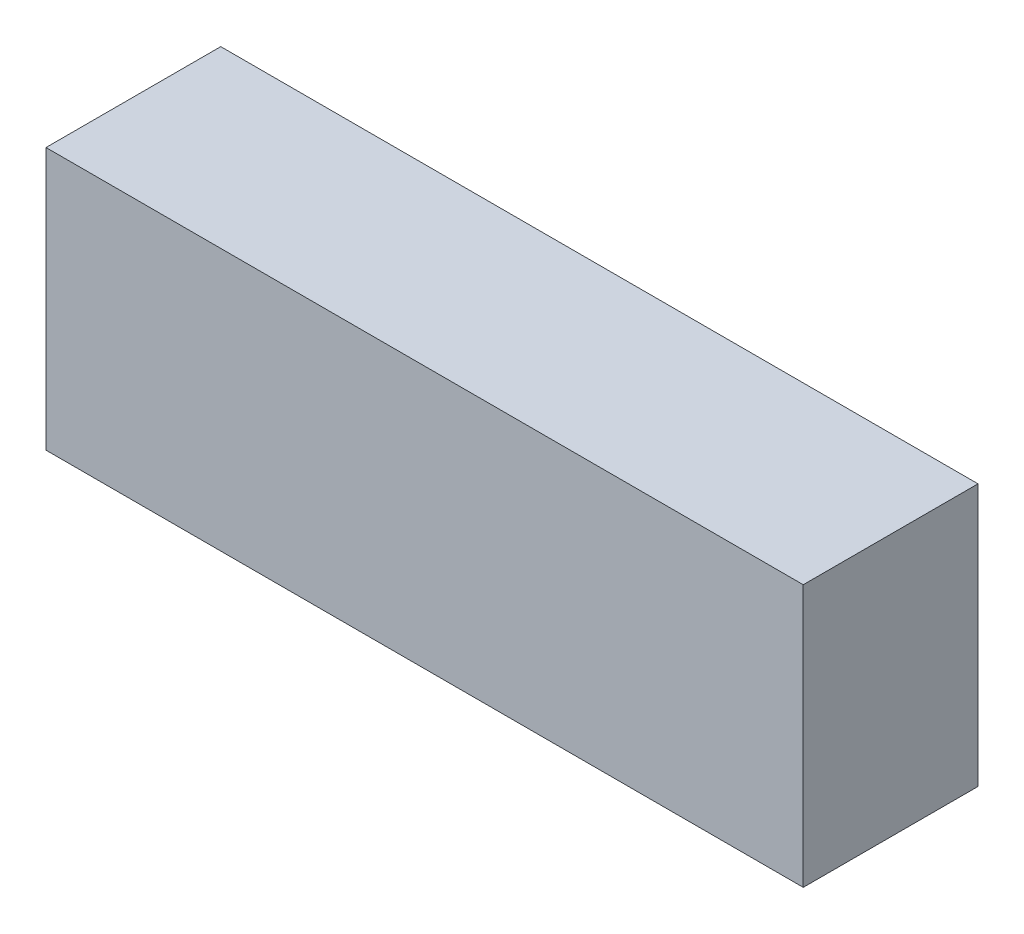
ISO-10303-21;
HEADER;
FILE_DESCRIPTION(('STEP AP214'),'2;1');
FILE_NAME('part.step','',(''),(''),'','','');
FILE_SCHEMA(('AUTOMOTIVE_DESIGN { 1 0 10303 214 1 1 1 1 }'));
ENDSEC;
DATA;
#1=APPLICATION_CONTEXT('core data for automotive mechanical design processes');
#2=APPLICATION_PROTOCOL_DEFINITION('international standard','automotive_design',2000,#1);
#3=PRODUCT_CONTEXT('',#1,'mechanical');
#4=PRODUCT('Part','Part','',(#3));
#5=PRODUCT_RELATED_PRODUCT_CATEGORY('part','',(#4));
#6=PRODUCT_DEFINITION_FORMATION('','',#4);
#7=PRODUCT_DEFINITION_CONTEXT('part definition',#1,'design');
#8=PRODUCT_DEFINITION('design','',#6,#7);
#9=PRODUCT_DEFINITION_SHAPE('','',#8);
#10=(LENGTH_UNIT() NAMED_UNIT(*) SI_UNIT(.MILLI.,.METRE.));
#11=(NAMED_UNIT(*) PLANE_ANGLE_UNIT() SI_UNIT($,.RADIAN.));
#12=(NAMED_UNIT(*) SI_UNIT($,.STERADIAN.) SOLID_ANGLE_UNIT());
#13=UNCERTAINTY_MEASURE_WITH_UNIT(LENGTH_MEASURE(1.E-05),#10,'distance_accuracy_value','');
#14=(GEOMETRIC_REPRESENTATION_CONTEXT(3) GLOBAL_UNCERTAINTY_ASSIGNED_CONTEXT((#13)) GLOBAL_UNIT_ASSIGNED_CONTEXT((#10,
#11,#12)) REPRESENTATION_CONTEXT('',''));
#15=CARTESIAN_POINT('',(0.,0.,0.));
#16=DIRECTION('',(0.,0.,1.));
#17=DIRECTION('',(1.,0.,0.));
#18=AXIS2_PLACEMENT_3D('',#15,#16,#17);
#19=CARTESIAN_POINT('',(0.,0.,30.));
#20=DIRECTION('',(0.,1.,0.));
#21=DIRECTION('',(0.,0.,1.));
#22=AXIS2_PLACEMENT_3D('',#19,#20,#21);
#23=PLANE('',#22);
#24=DIRECTION('',(1.,0.,0.));
#25=VECTOR('',#24,1.);
#26=CARTESIAN_POINT('',(0.,0.,0.));
#27=LINE('',#26,#25);
#28=CARTESIAN_POINT('',(2.,0.,0.));
#29=VERTEX_POINT('',#28);
#30=CARTESIAN_POINT('',(132.,0.,0.));
#31=VERTEX_POINT('',#30);
#32=EDGE_CURVE('E35',#29,#31,#27,.T.);
#33=ORIENTED_EDGE('',*,*,#32,.T.);
#34=DIRECTION('',(0.,0.,-1.));
#35=VECTOR('',#34,1.);
#36=CARTESIAN_POINT('',(132.,0.,30.));
#37=LINE('',#36,#35);
#38=CARTESIAN_POINT('',(132.,0.,30.));
#39=VERTEX_POINT('',#38);
#40=EDGE_CURVE('E74',#39,#31,#37,.T.);
#41=ORIENTED_EDGE('',*,*,#40,.F.);
#42=DIRECTION('',(1.,0.,0.));
#43=VECTOR('',#42,1.);
#44=CARTESIAN_POINT('',(0.,0.,30.));
#45=LINE('',#44,#43);
#46=CARTESIAN_POINT('',(2.,0.,30.));
#47=VERTEX_POINT('',#46);
#48=EDGE_CURVE('E11',#47,#39,#45,.T.);
#49=ORIENTED_EDGE('',*,*,#48,.F.);
#50=DIRECTION('',(0.,0.,1.));
#51=VECTOR('',#50,1.);
#52=CARTESIAN_POINT('',(2.,0.,30.));
#53=LINE('',#52,#51);
#54=EDGE_CURVE('E96',#29,#47,#53,.T.);
#55=ORIENTED_EDGE('',*,*,#54,.F.);
#56=EDGE_LOOP('',(#33,#41,#49,#55));
#57=FACE_BOUND('',#56,.T.);
#58=ADVANCED_FACE('F32',(#57),#23,.F.);
#59=CARTESIAN_POINT('',(0.,50.,30.));
#60=DIRECTION('',(0.,0.,-1.));
#61=DIRECTION('',(-1.,0.,0.));
#62=AXIS2_PLACEMENT_3D('',#59,#60,#61);
#63=PLANE('',#62);
#64=ORIENTED_EDGE('',*,*,#48,.T.);
#65=DIRECTION('',(0.,-1.,0.));
#66=VECTOR('',#65,1.);
#67=CARTESIAN_POINT('',(132.,0.,30.));
#68=LINE('',#67,#66);
#69=CARTESIAN_POINT('',(132.,45.,30.));
#70=VERTEX_POINT('',#69);
#71=EDGE_CURVE('E71',#70,#39,#68,.T.);
#72=ORIENTED_EDGE('',*,*,#71,.F.);
#73=DIRECTION('',(1.,0.,0.));
#74=VECTOR('',#73,1.);
#75=CARTESIAN_POINT('',(0.,45.,30.));
#76=LINE('',#75,#74);
#77=CARTESIAN_POINT('',(2.,45.,30.));
#78=VERTEX_POINT('',#77);
#79=EDGE_CURVE('E87',#78,#70,#76,.T.);
#80=ORIENTED_EDGE('',*,*,#79,.F.);
#81=DIRECTION('',(0.,1.,0.));
#82=VECTOR('',#81,1.);
#83=CARTESIAN_POINT('',(2.,0.,30.));
#84=LINE('',#83,#82);
#85=EDGE_CURVE('E54',#47,#78,#84,.T.);
#86=ORIENTED_EDGE('',*,*,#85,.F.);
#87=EDGE_LOOP('',(#64,#72,#80,#86));
#88=FACE_BOUND('',#87,.T.);
#89=ADVANCED_FACE('F86',(#88),#63,.F.);
#90=CARTESIAN_POINT('',(0.,50.,0.));
#91=DIRECTION('',(0.,0.,-1.));
#92=DIRECTION('',(-1.,0.,0.));
#93=AXIS2_PLACEMENT_3D('',#90,#91,#92);
#94=PLANE('',#93);
#95=DIRECTION('',(0.,1.,0.));
#96=VECTOR('',#95,1.);
#97=CARTESIAN_POINT('',(132.,0.,0.));
#98=LINE('',#97,#96);
#99=CARTESIAN_POINT('',(132.,45.,0.));
#100=VERTEX_POINT('',#99);
#101=EDGE_CURVE('E46',#31,#100,#98,.T.);
#102=ORIENTED_EDGE('',*,*,#101,.F.);
#103=ORIENTED_EDGE('',*,*,#32,.F.);
#104=DIRECTION('',(0.,-1.,0.));
#105=VECTOR('',#104,1.);
#106=CARTESIAN_POINT('',(2.,0.,0.));
#107=LINE('',#106,#105);
#108=CARTESIAN_POINT('',(2.,45.,0.));
#109=VERTEX_POINT('',#108);
#110=EDGE_CURVE('E90',#109,#29,#107,.T.);
#111=ORIENTED_EDGE('',*,*,#110,.F.);
#112=DIRECTION('',(-1.,0.,0.));
#113=VECTOR('',#112,1.);
#114=CARTESIAN_POINT('',(0.,45.,0.));
#115=LINE('',#114,#113);
#116=EDGE_CURVE('E99',#100,#109,#115,.T.);
#117=ORIENTED_EDGE('',*,*,#116,.F.);
#118=EDGE_LOOP('',(#102,#103,#111,#117));
#119=FACE_BOUND('',#118,.T.);
#120=ADVANCED_FACE('F106',(#119),#94,.T.);
#121=CARTESIAN_POINT('',(0.,45.,0.));
#122=DIRECTION('',(0.,-1.,0.));
#123=DIRECTION('',(0.,0.,-1.));
#124=AXIS2_PLACEMENT_3D('',#121,#122,#123);
#125=PLANE('',#124);
#126=ORIENTED_EDGE('',*,*,#79,.T.);
#127=DIRECTION('',(0.,0.,1.));
#128=VECTOR('',#127,1.);
#129=CARTESIAN_POINT('',(132.,45.,30.));
#130=LINE('',#129,#128);
#131=EDGE_CURVE('E75',#100,#70,#130,.T.);
#132=ORIENTED_EDGE('',*,*,#131,.F.);
#133=ORIENTED_EDGE('',*,*,#116,.T.);
#134=DIRECTION('',(0.,0.,-1.));
#135=VECTOR('',#134,1.);
#136=CARTESIAN_POINT('',(2.,45.,30.));
#137=LINE('',#136,#135);
#138=EDGE_CURVE('E88',#78,#109,#137,.T.);
#139=ORIENTED_EDGE('',*,*,#138,.F.);
#140=EDGE_LOOP('',(#126,#132,#133,#139));
#141=FACE_BOUND('',#140,.T.);
#142=ADVANCED_FACE('F102',(#141),#125,.F.);
#143=CARTESIAN_POINT('',(2.,45.,30.));
#144=DIRECTION('',(-1.,0.,0.));
#145=DIRECTION('',(0.,0.,1.));
#146=AXIS2_PLACEMENT_3D('',#143,#144,#145);
#147=PLANE('',#146);
#148=ORIENTED_EDGE('',*,*,#85,.T.);
#149=ORIENTED_EDGE('',*,*,#138,.T.);
#150=ORIENTED_EDGE('',*,*,#110,.T.);
#151=ORIENTED_EDGE('',*,*,#54,.T.);
#152=EDGE_LOOP('',(#148,#149,#150,#151));
#153=FACE_BOUND('',#152,.T.);
#154=ADVANCED_FACE('F105',(#153),#147,.T.);
#155=CARTESIAN_POINT('',(132.,45.,30.));
#156=DIRECTION('',(-1.,0.,0.));
#157=DIRECTION('',(0.,0.,1.));
#158=AXIS2_PLACEMENT_3D('',#155,#156,#157);
#159=PLANE('',#158);
#160=ORIENTED_EDGE('',*,*,#71,.T.);
#161=ORIENTED_EDGE('',*,*,#40,.T.);
#162=ORIENTED_EDGE('',*,*,#101,.T.);
#163=ORIENTED_EDGE('',*,*,#131,.T.);
#164=EDGE_LOOP('',(#160,#161,#162,#163));
#165=FACE_BOUND('',#164,.T.);
#166=ADVANCED_FACE('F73',(#165),#159,.F.);
#167=CLOSED_SHELL('',(#58,#89,#120,#142,#154,#166));
#168=MANIFOLD_SOLID_BREP('B2',#167);
#169=ADVANCED_BREP_SHAPE_REPRESENTATION('',(#18,#168),#14);
#170=SHAPE_DEFINITION_REPRESENTATION(#9,#169);
ENDSEC;
END-ISO-10303-21;
